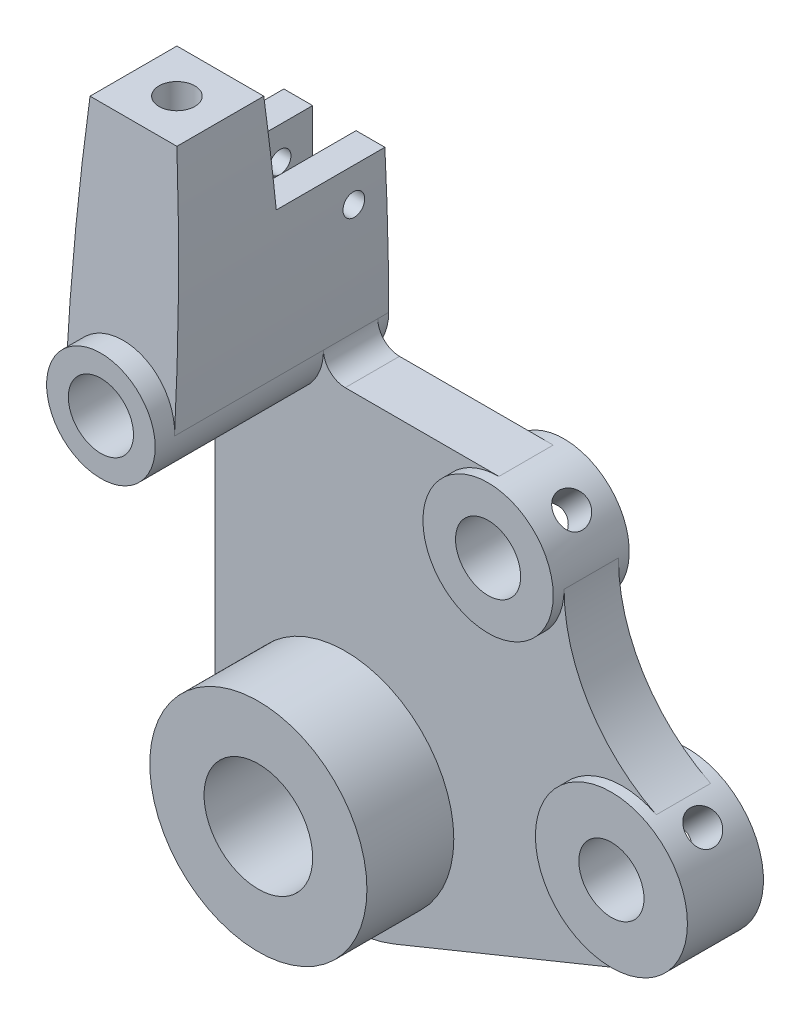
from build123d import *

# Parameters (mm, degrees)
EXTRUDE_1_DEPTH          = 5
SKETCH_2_R               = 6
SKETCH_2_R_2             = 7
EXTRUDE_2_DEPTH          = 1
SKETCH_3_R               = 10
EXTRUDE_3_DEPTH          = 8
EXTRUDE_4_DEPTH          = 14
CUT_EXTRUDE_1_DEPTH      = 5
EXTRUDE_6_REACH          = 69.1
SKETCH_7_R               = 5
EXTRUDE_START            = 1
SKETCH_12_R              = 10
EXTRUDE_7_DEPTH          = 1
SKETCH_10_W              = 10
SKETCH_10_H              = 15.5
CUT_EXTRUDE_4_DEPTH      = 2
SKETCH_9_R               = 2
SKETCH_9_R_2             = 5
SKETCH_9_R_3             = 3
CUT_EXTRUDE_3_DEPTH      = 68.412579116
SKETCH_13_R              = 1
CUT_EXTRUDE_5_DEPTH      = 5
SKETCH_14_R              = 3
CUT_EXTRUDE_6_DEPTH      = 10
CUT_EXTRUDE_7_REACH      = 55.529
CUT_EXTRUDE_7_END_RADIUS = 3
SKETCH_16_R              = 1.5
CUT_EXTRUDE_8_REACH      = 65.82
CUT_EXTRUDE_8_END_RADIUS = 3
SKETCH_17_R              = 1.5
HOLE_WIZARD_M4_1_D       = 3.3
HOLE_WIZARD_M4_1_DEPTH   = 8
HOLE_WIZARD_M4_1_TIP     = 0.991420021


with BuildPart() as part:
    # Sketch 1 → Extrude 1 (new body)
    with BuildSketch(Plane.XY):
        with BuildLine():
            Line((-12, 0), (-12, 33))
            ThreePointArc((-12, 33), (-11.749871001, 44.011357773), (-11, 55))
            Line((-11, 55), (-3, 55))
            ThreePointArc((-3, 55), (-2.250128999, 44.011357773), (-2, 33))
            ThreePointArc((-2, 33), (-1.414213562, 31.585786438), (0, 31))
            Line((0, 31), (14.156884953, 31))
            ThreePointArc((14.156884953, 31), (18.39952564, 29.242640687), (20.156884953, 25))
            ThreePointArc((20.156884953, 25), (22.450499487, 16.924548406), (28.646493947, 11.260341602))
            ThreePointArc((28.646493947, 11.260341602), (32.5095375, 4.731166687), (28.156756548, -1.482248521))
            Line((28.156756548, -1.482248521), (4.529236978, -11.112426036))
            ThreePointArc((4.529236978, -11.112426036), (-6.695115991, -9.95868575), (-12, 0))
        make_face()
    extrude(amount=EXTRUDE_1_DEPTH)

    # Sketch 2 → Extrude 2 (add)
    with BuildSketch(Plane.XY.offset(5)):
        with Locations((14.156884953, 25)):
            Circle(SKETCH_2_R)
        with Locations(Location((25.514701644, 5, 0), (0, 0, 292.174978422))):
            Circle(SKETCH_2_R_2)
    extrude(amount=EXTRUDE_2_DEPTH)

    # Sketch 3 → Extrude 3 (add)
    with BuildSketch(Plane.XY.offset(5)):
        Circle(SKETCH_3_R)
    extrude(amount=EXTRUDE_3_DEPTH)

    # Sketch 4 → Extrude 4 (add)
    with BuildSketch(Plane.XY.offset(5)):
        with BuildLine():
            Line((-11, 55), (-3, 55))
            ThreePointArc((-3, 55), (-2.250128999, 44.011357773), (-2, 33))
            ThreePointArc((-2, 33), (-7, 28), (-12, 33))
            ThreePointArc((-12, 33), (-11.749871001, 44.011357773), (-11, 55))
        make_face()
    extrude(amount=EXTRUDE_4_DEPTH)

    # Sketch 6 → Cut-Extrude 1 (cut, symmetric)
    with BuildSketch(Plane(origin=(-7, 0, 0), x_dir=(0, 0, -1), z_dir=(1, 0, 0))):
        Polygon((0, 46), (-9, 46), (-9.5, 55), (0, 55), align=None)
        Polygon((-17.5, 55), (-19, 28), (-19, 55), align=None)
    extrude(amount=CUT_EXTRUDE_1_DEPTH, both=True, mode=Mode.SUBTRACT)

    # Extrude 6: up to this face of the body (flat: up to its plane)
    extrude_6_end = Plane(part.part.faces().sort_by_distance((-7, 41.563784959, 18.246456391))[0])
    # Sketch 7 → Extrude 6 (add, up to the picked face)
    with BuildSketch(Plane.XY.offset(20.5), mode=Mode.PRIVATE) as extrude_6_sk1:
        with Locations((-7, 33)):
            Circle(SKETCH_7_R)
    extrude_6_tool1 = split(extrude(extrude_6_sk1.sketch, amount=-EXTRUDE_6_REACH, mode=Mode.PRIVATE), bisect_by=extrude_6_end, keep=Keep.BOTH, mode=Mode.PRIVATE)
    add(extrude_6_tool1.solids().sort_by(Axis((-7, 33, 20.5), (0, 0, -1)))[0])

    # Sketch 12 → Extrude 7 (add)
    with BuildSketch(Plane(origin=(0, 0, 0), x_dir=(-1, 0, 0), z_dir=(0, 0, -1)).offset(EXTRUDE_START)):
        with Locations(Location((0, 0, 0), (0, 0, 180))):
            Circle(SKETCH_12_R)
        with BuildLine():
            Line((11.651295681, 46), (2.348704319, 46))
            ThreePointArc((2.348704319, 46), (2.087191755, 39.502337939), (2, 33))
            ThreePointArc((2, 33), (7, 28), (12, 33))
            ThreePointArc((12, 33), (11.912808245, 39.502337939), (11.651295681, 46))
        make_face()
        with BuildLine():
            ThreePointArc((-14.156884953, 31), (-18.39952564, 29.242640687), (-20.156884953, 25))
            ThreePointArc((-20.156884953, 25), (-9.914244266, 20.757359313), (-14.156884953, 31))
        make_face()
        with BuildLine():
            ThreePointArc((-28.646493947, 11.260341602), (-32.5095375, 4.731166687), (-28.156756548, -1.482248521))
            ThreePointArc((-28.156756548, -1.482248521), (-18.519865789, 5.268833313), (-28.646493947, 11.260341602))
        make_face()
    extrude(amount=-EXTRUDE_7_DEPTH)

    # Sketch 10 → Cut-Extrude 4 (cut, symmetric)
    with BuildSketch(Plane(origin=(-7, 0, 0), x_dir=(0, 0, -1), z_dir=(1, 0, 0))):
        with Locations((-4, 38.25)):
            Rectangle(SKETCH_10_W, SKETCH_10_H)
    extrude(amount=CUT_EXTRUDE_4_DEPTH, both=True, mode=Mode.SUBTRACT)

    # Sketch 9 → Cut-Extrude 3 (cut, through all)
    with BuildSketch(Plane.XY.offset(20.5)):
        with Locations((-7, 33)):
            Circle(SKETCH_9_R)
        Circle(SKETCH_9_R_2)
        with Locations((14.156884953, 25)):
            Circle(SKETCH_9_R_3)
        with Locations((25.514701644, 5)):
            Circle(SKETCH_9_R_3)
    extrude(amount=-CUT_EXTRUDE_3_DEPTH, mode=Mode.SUBTRACT)

    # Sketch 13 → Cut-Extrude 5 (cut, symmetric)
    with BuildSketch(Plane(origin=(-7, 0, 0), x_dir=(0, 0, -1), z_dir=(1, 0, 0))):
        with Locations((-2, 43)):
            Circle(SKETCH_13_R)
    extrude(amount=CUT_EXTRUDE_5_DEPTH, both=True, mode=Mode.SUBTRACT)

    # Sketch 14 → Cut-Extrude 6 (cut)
    with BuildSketch(Plane.XY.offset(20.5)):
        with Locations((-7, 33)):
            Circle(SKETCH_14_R)
    extrude(amount=-CUT_EXTRUDE_6_DEPTH, mode=Mode.SUBTRACT)

    # Cut-Extrude 7: up to this cylinder (the profile starts outside it)
    cut_extrude_7_end = Plane(origin=(14.156884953, 25, 2.5), z_dir=(0, 0, 1)) * Cylinder(CUT_EXTRUDE_7_END_RADIUS, 118.058, mode=Mode.PRIVATE)
    # Sketch 16 → Cut-Extrude 7 (cut, up to the surface)
    with BuildSketch(Plane(origin=(18.39952564, 29.242640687, 5), x_dir=(0, 0, -1), z_dir=(0.707106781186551, 0.7071067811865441, 0)), mode=Mode.PRIVATE) as cut_extrude_7_sk1:
        with Locations(Location((2.5, 0, 0), (0, 0, 90))):
            Circle(SKETCH_16_R)
    cut_extrude_7_tool1 = extrude(cut_extrude_7_sk1.sketch, amount=-CUT_EXTRUDE_7_REACH, mode=Mode.PRIVATE) - cut_extrude_7_end
    add(cut_extrude_7_tool1.solids().sort_by_distance((18.399526, 29.242641, 2.5))[0], mode=Mode.SUBTRACT)

    # Cut-Extrude 8: up to this cylinder (the profile starts outside it)
    cut_extrude_8_end = Plane(origin=(25.514701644, 5, 2.5), z_dir=(0, 0, 1)) * Cylinder(CUT_EXTRUDE_8_END_RADIUS, 138.64, mode=Mode.PRIVATE)
    # Sketch 17 → Cut-Extrude 8 (cut, up to the surface)
    with BuildSketch(Plane(origin=(30.464449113, 9.949747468, 5), x_dir=(0, 0, -1), z_dir=(0.7071067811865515, 0.7071067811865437, 0)), mode=Mode.PRIVATE) as cut_extrude_8_sk1:
        with Locations(Location((2.5, 0, 0), (0, 0, 90))):
            Circle(SKETCH_17_R)
    cut_extrude_8_tool1 = extrude(cut_extrude_8_sk1.sketch, amount=-CUT_EXTRUDE_8_REACH, mode=Mode.PRIVATE) - cut_extrude_8_end
    add(cut_extrude_8_tool1.solids().sort_by_distance((30.464449, 9.949747, 2.5))[0], mode=Mode.SUBTRACT)

    # Hole Wizard M4 _1
    with Locations(Plane(origin=(0, 55, 0), x_dir=(-1, 0, 0), z_dir=(0, 1, 0))):
        with Locations((7, 13.5)):
            Hole(HOLE_WIZARD_M4_1_D / 2, depth=HOLE_WIZARD_M4_1_DEPTH)
            with Locations((0, 0, -(HOLE_WIZARD_M4_1_DEPTH + HOLE_WIZARD_M4_1_TIP / 2))):  # 118° drill point
                Cone(0, HOLE_WIZARD_M4_1_D / 2, HOLE_WIZARD_M4_1_TIP, mode=Mode.SUBTRACT)


solid = part.part
